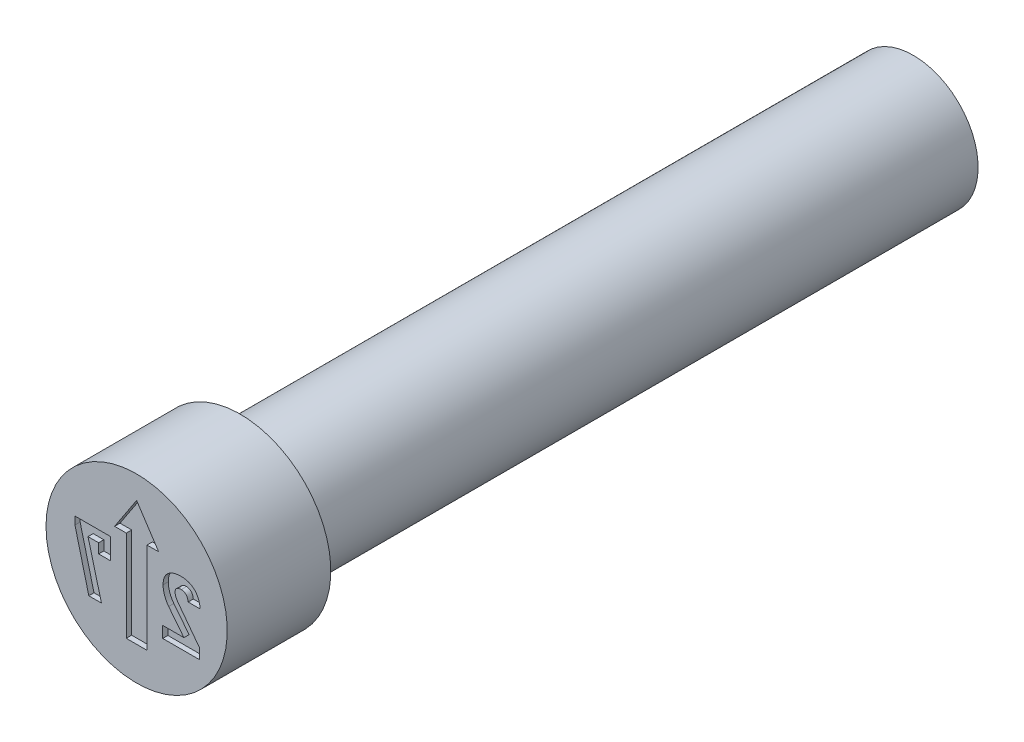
ISO-10303-21;
HEADER;
FILE_DESCRIPTION(('STEP AP214'),'2;1');
FILE_NAME('part.step','',(''),(''),'','','');
FILE_SCHEMA(('AUTOMOTIVE_DESIGN { 1 0 10303 214 1 1 1 1 }'));
ENDSEC;
DATA;
#1=APPLICATION_CONTEXT('core data for automotive mechanical design processes');
#2=APPLICATION_PROTOCOL_DEFINITION('international standard','automotive_design',2000,#1);
#3=PRODUCT_CONTEXT('',#1,'mechanical');
#4=PRODUCT('Part','Part','',(#3));
#5=PRODUCT_RELATED_PRODUCT_CATEGORY('part','',(#4));
#6=PRODUCT_DEFINITION_FORMATION('','',#4);
#7=PRODUCT_DEFINITION_CONTEXT('part definition',#1,'design');
#8=PRODUCT_DEFINITION('design','',#6,#7);
#9=PRODUCT_DEFINITION_SHAPE('','',#8);
#10=(LENGTH_UNIT() NAMED_UNIT(*) SI_UNIT(.MILLI.,.METRE.));
#11=(NAMED_UNIT(*) PLANE_ANGLE_UNIT() SI_UNIT($,.RADIAN.));
#12=(NAMED_UNIT(*) SI_UNIT($,.STERADIAN.) SOLID_ANGLE_UNIT());
#13=UNCERTAINTY_MEASURE_WITH_UNIT(LENGTH_MEASURE(1.E-05),#10,'distance_accuracy_value','');
#14=(GEOMETRIC_REPRESENTATION_CONTEXT(3) GLOBAL_UNCERTAINTY_ASSIGNED_CONTEXT((#13)) GLOBAL_UNIT_ASSIGNED_CONTEXT((#10,
#11,#12)) REPRESENTATION_CONTEXT('',''));
#15=CARTESIAN_POINT('',(0.,0.,0.));
#16=DIRECTION('',(0.,0.,1.));
#17=DIRECTION('',(1.,0.,0.));
#18=AXIS2_PLACEMENT_3D('',#15,#16,#17);
#19=CARTESIAN_POINT('',(-0.2,-1.1,-2.08977062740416));
#20=DIRECTION('',(-1.,0.,0.));
#21=DIRECTION('',(0.,0.,1.));
#22=AXIS2_PLACEMENT_3D('',#19,#20,#21);
#23=PLANE('',#22);
#24=DIRECTION('',(0.,-1.,0.));
#25=VECTOR('',#24,1.);
#26=CARTESIAN_POINT('',(-0.2,0.660419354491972,-0.10447943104));
#27=LINE('',#26,#25);
#28=CARTESIAN_POINT('',(-0.2,0.660419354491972,-0.10447943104));
#29=VERTEX_POINT('',#28);
#30=CARTESIAN_POINT('',(-0.2,-1.1,-0.10447943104));
#31=VERTEX_POINT('',#30);
#32=EDGE_CURVE('E439',#29,#31,#27,.T.);
#33=ORIENTED_EDGE('',*,*,#32,.F.);
#34=DIRECTION('',(0.,0.,1.));
#35=VECTOR('',#34,1.);
#36=CARTESIAN_POINT('',(-0.2,0.660419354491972,-0.14223971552));
#37=LINE('',#36,#35);
#38=CARTESIAN_POINT('',(-0.2,0.660419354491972,0.));
#39=VERTEX_POINT('',#38);
#40=EDGE_CURVE('E425',#39,#29,#37,.F.);
#41=ORIENTED_EDGE('',*,*,#40,.F.);
#42=DIRECTION('',(0.,1.,0.));
#43=VECTOR('',#42,1.);
#44=CARTESIAN_POINT('',(-0.2,0.,0.));
#45=LINE('',#44,#43);
#46=CARTESIAN_POINT('',(-0.2,-1.1,0.));
#47=VERTEX_POINT('',#46);
#48=EDGE_CURVE('E468',#47,#39,#45,.T.);
#49=ORIENTED_EDGE('',*,*,#48,.F.);
#50=DIRECTION('',(0.,0.,-1.));
#51=VECTOR('',#50,1.);
#52=CARTESIAN_POINT('',(-0.2,-1.1,-2.08977062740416));
#53=LINE('',#52,#51);
#54=EDGE_CURVE('E470',#47,#31,#53,.T.);
#55=ORIENTED_EDGE('',*,*,#54,.T.);
#56=EDGE_LOOP('',(#33,#41,#49,#55));
#57=FACE_BOUND('',#56,.T.);
#58=ADVANCED_FACE('F37',(#57),#23,.F.);
#59=CARTESIAN_POINT('',(2.771111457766E-13,0.660419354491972,-0.14223971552));
#60=DIRECTION('',(0.,1.,0.));
#61=DIRECTION('',(0.,0.,1.));
#62=AXIS2_PLACEMENT_3D('',#59,#60,#61);
#63=PLANE('',#62);
#64=ORIENTED_EDGE('',*,*,#40,.T.);
#65=DIRECTION('',(1.,0.,0.));
#66=VECTOR('',#65,1.);
#67=CARTESIAN_POINT('',(-0.425641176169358,0.660419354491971,-0.10447943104));
#68=LINE('',#67,#66);
#69=CARTESIAN_POINT('',(-0.425641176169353,0.660419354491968,-0.10447943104));
#70=VERTEX_POINT('',#69);
#71=EDGE_CURVE('E427',#70,#29,#68,.T.);
#72=ORIENTED_EDGE('',*,*,#71,.F.);
#73=DIRECTION('',(0.,0.,1.));
#74=VECTOR('',#73,1.);
#75=CARTESIAN_POINT('',(-0.425641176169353,0.660419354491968,-0.65023869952));
#76=LINE('',#75,#74);
#77=CARTESIAN_POINT('',(-0.425641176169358,0.660419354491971,0.));
#78=VERTEX_POINT('',#77);
#79=EDGE_CURVE('E432',#70,#78,#76,.T.);
#80=ORIENTED_EDGE('',*,*,#79,.T.);
#81=DIRECTION('',(1.,0.,0.));
#82=VECTOR('',#81,1.);
#83=CARTESIAN_POINT('',(0.87499825,0.660419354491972,0.));
#84=LINE('',#83,#82);
#85=EDGE_CURVE('E430',#39,#78,#84,.F.);
#86=ORIENTED_EDGE('',*,*,#85,.F.);
#87=EDGE_LOOP('',(#64,#72,#80,#86));
#88=FACE_BOUND('',#87,.T.);
#89=ADVANCED_FACE('F415',(#88),#63,.T.);
#90=CARTESIAN_POINT('',(-0.721917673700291,0.210715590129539,-0.65023869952));
#91=DIRECTION('',(-0.835059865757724,0.550159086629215,0.));
#92=DIRECTION('',(-0.550159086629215,-0.835059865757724,0.));
#93=AXIS2_PLACEMENT_3D('',#90,#91,#92);
#94=PLANE('',#93);
#95=DIRECTION('',(-0.55015908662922,-0.835059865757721,0.));
#96=VECTOR('',#95,1.);
#97=CARTESIAN_POINT('',(0.,1.30647950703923,-0.10447943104));
#98=LINE('',#97,#96);
#99=CARTESIAN_POINT('',(0.,1.30647950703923,-0.10447943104));
#100=VERTEX_POINT('',#99);
#101=EDGE_CURVE('E441',#100,#70,#98,.T.);
#102=ORIENTED_EDGE('',*,*,#101,.F.);
#103=DIRECTION('',(0.,0.,1.));
#104=VECTOR('',#103,1.);
#105=CARTESIAN_POINT('',(0.,1.30647950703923,-0.65023869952));
#106=LINE('',#105,#104);
#107=CARTESIAN_POINT('',(0.,1.30647950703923,0.));
#108=VERTEX_POINT('',#107);
#109=EDGE_CURVE('E480',#100,#108,#106,.T.);
#110=ORIENTED_EDGE('',*,*,#109,.T.);
#111=DIRECTION('',(0.550159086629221,0.83505986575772,0.));
#112=VECTOR('',#111,1.);
#113=CARTESIAN_POINT('',(-0.425641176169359,0.660419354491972,0.));
#114=LINE('',#113,#112);
#115=EDGE_CURVE('E464',#78,#108,#114,.T.);
#116=ORIENTED_EDGE('',*,*,#115,.F.);
#117=ORIENTED_EDGE('',*,*,#79,.F.);
#118=EDGE_LOOP('',(#102,#110,#116,#117));
#119=FACE_BOUND('',#118,.T.);
#120=ADVANCED_FACE('F412',(#119),#94,.F.);
#121=CARTESIAN_POINT('',(0.,1.30647950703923,-0.65023869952));
#122=DIRECTION('',(0.835059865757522,0.550159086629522,0.));
#123=DIRECTION('',(-0.550159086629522,0.835059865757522,0.));
#124=AXIS2_PLACEMENT_3D('',#121,#122,#123);
#125=PLANE('',#124);
#126=DIRECTION('',(-0.550159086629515,0.835059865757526,0.));
#127=VECTOR('',#126,1.);
#128=CARTESIAN_POINT('',(0.425641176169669,0.660419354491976,-0.10447943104));
#129=LINE('',#128,#127);
#130=CARTESIAN_POINT('',(0.425641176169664,0.660419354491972,-0.10447943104));
#131=VERTEX_POINT('',#130);
#132=EDGE_CURVE('E445',#131,#100,#129,.T.);
#133=ORIENTED_EDGE('',*,*,#132,.F.);
#134=DIRECTION('',(0.,0.,1.));
#135=VECTOR('',#134,1.);
#136=CARTESIAN_POINT('',(0.425641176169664,0.660419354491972,-0.14223971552));
#137=LINE('',#136,#135);
#138=CARTESIAN_POINT('',(0.425641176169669,0.660419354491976,0.));
#139=VERTEX_POINT('',#138);
#140=EDGE_CURVE('E477',#139,#131,#137,.F.);
#141=ORIENTED_EDGE('',*,*,#140,.F.);
#142=DIRECTION('',(0.550159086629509,-0.83505986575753,0.));
#143=VECTOR('',#142,1.);
#144=CARTESIAN_POINT('',(0.,1.30647950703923,0.));
#145=LINE('',#144,#143);
#146=EDGE_CURVE('E461',#108,#139,#145,.T.);
#147=ORIENTED_EDGE('',*,*,#146,.F.);
#148=ORIENTED_EDGE('',*,*,#109,.F.);
#149=EDGE_LOOP('',(#133,#141,#147,#148));
#150=FACE_BOUND('',#149,.T.);
#151=ADVANCED_FACE('F408',(#150),#125,.F.);
#152=CARTESIAN_POINT('',(2.771111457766E-13,0.660419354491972,-0.14223971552));
#153=DIRECTION('',(0.,1.,0.));
#154=DIRECTION('',(0.,0.,1.));
#155=AXIS2_PLACEMENT_3D('',#152,#153,#154);
#156=PLANE('',#155);
#157=ORIENTED_EDGE('',*,*,#140,.T.);
#158=DIRECTION('',(1.,0.,0.));
#159=VECTOR('',#158,1.);
#160=CARTESIAN_POINT('',(0.2,0.660419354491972,-0.10447943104));
#161=LINE('',#160,#159);
#162=CARTESIAN_POINT('',(0.2,0.660419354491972,-0.10447943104));
#163=VERTEX_POINT('',#162);
#164=EDGE_CURVE('E502',#163,#131,#161,.T.);
#165=ORIENTED_EDGE('',*,*,#164,.F.);
#166=DIRECTION('',(0.,0.,1.));
#167=VECTOR('',#166,1.);
#168=CARTESIAN_POINT('',(0.2,0.660419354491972,-2.08977062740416));
#169=LINE('',#168,#167);
#170=CARTESIAN_POINT('',(0.2,0.660419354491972,0.));
#171=VERTEX_POINT('',#170);
#172=EDGE_CURVE('E475',#163,#171,#169,.T.);
#173=ORIENTED_EDGE('',*,*,#172,.T.);
#174=DIRECTION('',(1.,0.,0.));
#175=VECTOR('',#174,1.);
#176=CARTESIAN_POINT('',(0.87499825,0.660419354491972,0.));
#177=LINE('',#176,#175);
#178=EDGE_CURVE('E458',#139,#171,#177,.F.);
#179=ORIENTED_EDGE('',*,*,#178,.F.);
#180=EDGE_LOOP('',(#157,#165,#173,#179));
#181=FACE_BOUND('',#180,.T.);
#182=ADVANCED_FACE('F404',(#181),#156,.T.);
#183=CARTESIAN_POINT('',(0.2,-1.1,-2.08977062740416));
#184=DIRECTION('',(1.,0.,0.));
#185=DIRECTION('',(0.,1.,0.));
#186=AXIS2_PLACEMENT_3D('',#183,#184,#185);
#187=PLANE('',#186);
#188=DIRECTION('',(0.,1.,0.));
#189=VECTOR('',#188,1.);
#190=CARTESIAN_POINT('',(0.2,-1.1,-0.10447943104));
#191=LINE('',#190,#189);
#192=CARTESIAN_POINT('',(0.2,-1.1,-0.10447943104));
#193=VERTEX_POINT('',#192);
#194=EDGE_CURVE('E433',#193,#163,#191,.T.);
#195=ORIENTED_EDGE('',*,*,#194,.F.);
#196=DIRECTION('',(0.,0.,-1.));
#197=VECTOR('',#196,1.);
#198=CARTESIAN_POINT('',(0.2,-1.1,-2.08977062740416));
#199=LINE('',#198,#197);
#200=CARTESIAN_POINT('',(0.2,-1.1,0.));
#201=VERTEX_POINT('',#200);
#202=EDGE_CURVE('E473',#193,#201,#199,.F.);
#203=ORIENTED_EDGE('',*,*,#202,.T.);
#204=DIRECTION('',(0.,1.,0.));
#205=VECTOR('',#204,1.);
#206=CARTESIAN_POINT('',(0.2,0.,0.));
#207=LINE('',#206,#205);
#208=EDGE_CURVE('E455',#171,#201,#207,.F.);
#209=ORIENTED_EDGE('',*,*,#208,.F.);
#210=ORIENTED_EDGE('',*,*,#172,.F.);
#211=EDGE_LOOP('',(#195,#203,#209,#210));
#212=FACE_BOUND('',#211,.T.);
#213=ADVANCED_FACE('F400',(#212),#187,.F.);
#214=CARTESIAN_POINT('',(-0.2,-1.1,-2.08977062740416));
#215=DIRECTION('',(0.,-1.,0.));
#216=DIRECTION('',(0.,0.,-1.));
#217=AXIS2_PLACEMENT_3D('',#214,#215,#216);
#218=PLANE('',#217);
#219=DIRECTION('',(1.,0.,0.));
#220=VECTOR('',#219,1.);
#221=CARTESIAN_POINT('',(-0.2,-1.1,-0.10447943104));
#222=LINE('',#221,#220);
#223=EDGE_CURVE('E443',#31,#193,#222,.T.);
#224=ORIENTED_EDGE('',*,*,#223,.F.);
#225=ORIENTED_EDGE('',*,*,#54,.F.);
#226=DIRECTION('',(1.,0.,0.));
#227=VECTOR('',#226,1.);
#228=CARTESIAN_POINT('',(0.87499825,-1.1,0.));
#229=LINE('',#228,#227);
#230=EDGE_CURVE('E452',#201,#47,#229,.F.);
#231=ORIENTED_EDGE('',*,*,#230,.F.);
#232=ORIENTED_EDGE('',*,*,#202,.F.);
#233=EDGE_LOOP('',(#224,#225,#231,#232));
#234=FACE_BOUND('',#233,.T.);
#235=ADVANCED_FACE('F383',(#234),#218,.F.);
#236=CARTESIAN_POINT('',(0.87499825,0.,0.));
#237=DIRECTION('',(0.,0.,1.));
#238=DIRECTION('',(1.,0.,0.));
#239=AXIS2_PLACEMENT_3D('',#236,#237,#238);
#240=PLANE('',#239);
#241=DIRECTION('',(-1.,0.,0.));
#242=VECTOR('',#241,1.);
#243=CARTESIAN_POINT('',(-0.50825974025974,0.45,0.));
#244=LINE('',#243,#242);
#245=CARTESIAN_POINT('',(-0.50825974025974,0.45,0.));
#246=VERTEX_POINT('',#245);
#247=CARTESIAN_POINT('',(-1.19105194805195,0.45,0.));
#248=VERTEX_POINT('',#247);
#249=EDGE_CURVE('E53',#246,#248,#244,.T.);
#250=ORIENTED_EDGE('',*,*,#249,.F.);
#251=DIRECTION('',(0.,1.,0.));
#252=VECTOR('',#251,1.);
#253=CARTESIAN_POINT('',(-0.50825974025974,0.0448051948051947,0.));
#254=LINE('',#253,#252);
#255=CARTESIAN_POINT('',(-0.50825974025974,0.0448051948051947,0.));
#256=VERTEX_POINT('',#255);
#257=EDGE_CURVE('E274',#256,#246,#254,.T.);
#258=ORIENTED_EDGE('',*,*,#257,.F.);
#259=DIRECTION('',(1.,0.,0.));
#260=VECTOR('',#259,1.);
#261=CARTESIAN_POINT('',(-0.733503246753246,0.0448051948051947,0.));
#262=LINE('',#261,#260);
#263=CARTESIAN_POINT('',(-0.733503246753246,0.0448051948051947,0.));
#264=VERTEX_POINT('',#263);
#265=EDGE_CURVE('E277',#264,#256,#262,.T.);
#266=ORIENTED_EDGE('',*,*,#265,.F.);
#267=DIRECTION('',(0.,-1.,0.));
#268=VECTOR('',#267,1.);
#269=CARTESIAN_POINT('',(-0.733503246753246,0.231818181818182,0.));
#270=LINE('',#269,#268);
#271=CARTESIAN_POINT('',(-0.733503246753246,0.231818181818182,0.));
#272=VERTEX_POINT('',#271);
#273=EDGE_CURVE('E311',#272,#264,#270,.T.);
#274=ORIENTED_EDGE('',*,*,#273,.F.);
#275=DIRECTION('',(1.,0.,0.));
#276=VECTOR('',#275,1.);
#277=CARTESIAN_POINT('',(-0.93877922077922,0.231818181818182,0.));
#278=LINE('',#277,#276);
#279=CARTESIAN_POINT('',(-0.93877922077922,0.231818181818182,0.));
#280=VERTEX_POINT('',#279);
#281=EDGE_CURVE('E308',#280,#272,#278,.T.);
#282=ORIENTED_EDGE('',*,*,#281,.F.);
#283=DIRECTION('',(-0.255602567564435,0.966781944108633,0.));
#284=VECTOR('',#283,1.);
#285=CARTESIAN_POINT('',(-0.679201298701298,-0.75,0.));
#286=LINE('',#285,#284);
#287=CARTESIAN_POINT('',(-0.679201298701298,-0.75,0.));
#288=VERTEX_POINT('',#287);
#289=EDGE_CURVE('E305',#288,#280,#286,.T.);
#290=ORIENTED_EDGE('',*,*,#289,.F.);
#291=DIRECTION('',(1.,0.,0.));
#292=VECTOR('',#291,1.);
#293=CARTESIAN_POINT('',(-0.923194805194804,-0.75,0.));
#294=LINE('',#293,#292);
#295=CARTESIAN_POINT('',(-0.923194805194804,-0.75,0.));
#296=VERTEX_POINT('',#295);
#297=EDGE_CURVE('E302',#296,#288,#294,.T.);
#298=ORIENTED_EDGE('',*,*,#297,.F.);
#299=DIRECTION('',(0.247293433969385,-0.968940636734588,0.));
#300=VECTOR('',#299,1.);
#301=CARTESIAN_POINT('',(-1.19105194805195,0.299512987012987,0.));
#302=LINE('',#301,#300);
#303=CARTESIAN_POINT('',(-1.19105194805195,0.299512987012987,0.));
#304=VERTEX_POINT('',#303);
#305=EDGE_CURVE('E299',#304,#296,#302,.T.);
#306=ORIENTED_EDGE('',*,*,#305,.F.);
#307=DIRECTION('',(0.,-1.,0.));
#308=VECTOR('',#307,1.);
#309=CARTESIAN_POINT('',(-1.19105194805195,0.45,0.));
#310=LINE('',#309,#308);
#311=EDGE_CURVE('E297',#248,#304,#310,.T.);
#312=ORIENTED_EDGE('',*,*,#311,.F.);
#313=EDGE_LOOP('',(#250,#258,#266,#274,#282,#290,#298,#306,#312));
#314=FACE_BOUND('',#313,.T.);
#315=DIRECTION('',(1.,0.,0.));
#316=VECTOR('',#315,1.);
#317=CARTESIAN_POINT('',(0.504464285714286,-0.75,0.));
#318=LINE('',#317,#316);
#319=CARTESIAN_POINT('',(0.504464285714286,-0.75,0.));
#320=VERTEX_POINT('',#319);
#321=CARTESIAN_POINT('',(1.21112012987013,-0.75,0.));
#322=VERTEX_POINT('',#321);
#323=EDGE_CURVE('E61',#320,#322,#318,.T.);
#324=ORIENTED_EDGE('',*,*,#323,.F.);
#325=DIRECTION('',(0.,-1.,0.));
#326=VECTOR('',#325,1.);
#327=CARTESIAN_POINT('',(0.504464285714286,-0.531818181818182,0.));
#328=LINE('',#327,#326);
#329=CARTESIAN_POINT('',(0.504464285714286,-0.531818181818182,0.));
#330=VERTEX_POINT('',#329);
#331=EDGE_CURVE('E335',#330,#320,#328,.T.);
#332=ORIENTED_EDGE('',*,*,#331,.F.);
#333=DIRECTION('',(-1.,0.,0.));
#334=VECTOR('',#333,1.);
#335=CARTESIAN_POINT('',(0.912824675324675,-0.531818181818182,0.));
#336=LINE('',#335,#334);
#337=CARTESIAN_POINT('',(0.912824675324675,-0.531818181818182,0.));
#338=VERTEX_POINT('',#337);
#339=EDGE_CURVE('E542',#338,#330,#336,.T.);
#340=ORIENTED_EDGE('',*,*,#339,.F.);
#341=DIRECTION('',(0.618183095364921,-0.786034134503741,0.));
#342=VECTOR('',#341,1.);
#343=CARTESIAN_POINT('',(0.618668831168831,-0.157792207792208,0.));
#344=LINE('',#343,#342);
#345=CARTESIAN_POINT('',(0.618668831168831,-0.157792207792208,0.));
#346=VERTEX_POINT('',#345);
#347=EDGE_CURVE('E545',#346,#338,#344,.T.);
#348=ORIENTED_EDGE('',*,*,#347,.F.);
#349=CARTESIAN_POINT('',(0.511038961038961,0.150974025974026,0.));
#350=CARTESIAN_POINT('',(0.511349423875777,0.137320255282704,0.));
#351=CARTESIAN_POINT('',(0.511970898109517,0.10998858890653,0.));
#352=CARTESIAN_POINT('',(0.5175807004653,0.0690829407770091,0.));
#353=CARTESIAN_POINT('',(0.52662078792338,0.0283861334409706,0.));
#354=CARTESIAN_POINT('',(0.539036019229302,-0.0119052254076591,0.));
#355=CARTESIAN_POINT('',(0.554458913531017,-0.0510932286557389,0.));
#356=CARTESIAN_POINT('',(0.572969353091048,-0.0886411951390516,0.));
#357=CARTESIAN_POINT('',(0.593860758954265,-0.124565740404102,0.));
#358=CARTESIAN_POINT('',(0.610415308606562,-0.146737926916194,0.));
#359=CARTESIAN_POINT('',(0.618668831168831,-0.157792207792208,0.));
#360=B_SPLINE_CURVE_WITH_KNOTS('',3,(#349,#350,#351,#352,#353,#354,#355,#356,#357,#358,#359),
.UNSPECIFIED.,.F.,.F.,(4,1,1,1,1,1,1,1,4),(0.,0.123046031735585,0.246309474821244,
0.371480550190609,0.498560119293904,0.626024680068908,0.750715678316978,0.875715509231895,1.),.UNSPECIFIED.);
#361=CARTESIAN_POINT('',(0.511038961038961,0.150974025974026,0.));
#362=VERTEX_POINT('',#361);
#363=EDGE_CURVE('E548',#362,#346,#360,.T.);
#364=ORIENTED_EDGE('',*,*,#363,.F.);
#365=DIRECTION('',(0.,-1.,0.));
#366=VECTOR('',#365,1.);
#367=CARTESIAN_POINT('',(0.511038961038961,0.151948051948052,0.));
#368=LINE('',#367,#366);
#369=CARTESIAN_POINT('',(0.511038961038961,0.151948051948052,0.));
#370=VERTEX_POINT('',#369);
#371=EDGE_CURVE('E553',#370,#362,#368,.T.);
#372=ORIENTED_EDGE('',*,*,#371,.F.);
#373=CARTESIAN_POINT('',(0.864366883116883,0.465584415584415,0.));
#374=CARTESIAN_POINT('',(0.850719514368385,0.465390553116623,0.));
#375=CARTESIAN_POINT('',(0.824177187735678,0.465013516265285,0.));
#376=CARTESIAN_POINT('',(0.785536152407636,0.460943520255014,0.));
#377=CARTESIAN_POINT('',(0.749179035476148,0.454800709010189,0.));
#378=CARTESIAN_POINT('',(0.715164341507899,0.445814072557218,0.));
#379=CARTESIAN_POINT('',(0.683628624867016,0.434091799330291,0.));
#380=CARTESIAN_POINT('',(0.654477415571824,0.419957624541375,0.));
#381=CARTESIAN_POINT('',(0.62764977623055,0.403291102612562,0.));
#382=CARTESIAN_POINT('',(0.603351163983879,0.38405660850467,0.));
#383=CARTESIAN_POINT('',(0.581488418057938,0.362603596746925,0.));
#384=CARTESIAN_POINT('',(0.562670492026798,0.338714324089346,0.));
#385=CARTESIAN_POINT('',(0.54638045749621,0.312871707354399,0.));
#386=CARTESIAN_POINT('',(0.533646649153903,0.2845745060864,0.));
#387=CARTESIAN_POINT('',(0.523163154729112,0.254488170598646,0.));
#388=CARTESIAN_POINT('',(0.516375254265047,0.222073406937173,0.));
#389=CARTESIAN_POINT('',(0.51180107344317,0.187711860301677,0.));
#390=CARTESIAN_POINT('',(0.511297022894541,0.164058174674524,0.));
#391=CARTESIAN_POINT('',(0.511038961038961,0.151948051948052,0.));
#392=B_SPLINE_CURVE_WITH_KNOTS('',3,(#373,#374,#375,#376,#377,#378,#379,#380,#381,#382,#383,
#384,#385,#386,#387,#388,#389,#390,#391),.UNSPECIFIED.,.F.,.F.,(4,1,1,1,1,1,1,1,1,1,1,1,1,1,1,1,
4),(0.,0.0762312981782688,0.148259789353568,0.216860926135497,0.28210063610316,
0.344528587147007,0.404571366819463,0.462840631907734,0.520642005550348,0.577409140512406,
0.633580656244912,0.690215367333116,0.747647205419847,0.806597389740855,0.867894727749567,
0.932365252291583,1.),.UNSPECIFIED.);
#393=CARTESIAN_POINT('',(0.864366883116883,0.465584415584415,0.));
#394=VERTEX_POINT('',#393);
#395=EDGE_CURVE('E559',#394,#370,#392,.T.);
#396=ORIENTED_EDGE('',*,*,#395,.F.);
#397=CARTESIAN_POINT('',(1.22597402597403,0.105438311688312,0.));
#398=CARTESIAN_POINT('',(1.22483495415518,0.11934799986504,0.));
#399=CARTESIAN_POINT('',(1.2226115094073,0.146499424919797,0.));
#400=CARTESIAN_POINT('',(1.21532209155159,0.185775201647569,0.));
#401=CARTESIAN_POINT('',(1.20590080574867,0.22277029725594,0.));
#402=CARTESIAN_POINT('',(1.19391566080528,0.257477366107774,0.));
#403=CARTESIAN_POINT('',(1.17851470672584,0.289494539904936,0.));
#404=CARTESIAN_POINT('',(1.16121126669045,0.3194911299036,0.));
#405=CARTESIAN_POINT('',(1.14039956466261,0.346539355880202,0.));
#406=CARTESIAN_POINT('',(1.11761824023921,0.371544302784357,0.));
#407=CARTESIAN_POINT('',(1.09224391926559,0.393568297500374,0.));
#408=CARTESIAN_POINT('',(1.06518792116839,0.412996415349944,0.));
#409=CARTESIAN_POINT('',(1.03604111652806,0.429163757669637,0.));
#410=CARTESIAN_POINT('',(1.00524661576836,0.442575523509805,0.));
#411=CARTESIAN_POINT('',(0.972462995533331,0.452754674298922,0.));
#412=CARTESIAN_POINT('',(0.938118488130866,0.460379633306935,0.));
#413=CARTESIAN_POINT('',(0.90181888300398,0.464776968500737,0.));
#414=CARTESIAN_POINT('',(0.877040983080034,0.465311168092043,0.));
#415=CARTESIAN_POINT('',(0.864366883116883,0.465584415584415,0.));
#416=B_SPLINE_CURVE_WITH_KNOTS('',3,(#397,#398,#399,#400,#401,#402,#403,#404,#405,#406,#407,
#408,#409,#410,#411,#412,#413,#414,#415),.UNSPECIFIED.,.F.,.F.,(4,1,1,1,1,1,1,1,1,1,1,1,1,1,1,1,
4),(0.,0.0733268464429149,0.14313249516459,0.209679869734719,0.273918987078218,0.33576228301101,
0.396210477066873,0.45560885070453,0.514796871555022,0.573764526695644,0.631900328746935,
0.689592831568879,0.748648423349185,0.808163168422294,0.86976604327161,0.933384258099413,1.),.UNSPECIFIED.);
#417=CARTESIAN_POINT('',(1.22597402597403,0.105438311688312,0.));
#418=VERTEX_POINT('',#417);
#419=EDGE_CURVE('E564',#418,#394,#416,.T.);
#420=ORIENTED_EDGE('',*,*,#419,.F.);
#421=DIRECTION('',(0.,1.,0.));
#422=VECTOR('',#421,1.);
#423=CARTESIAN_POINT('',(1.22597402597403,0.104707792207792,0.));
#424=LINE('',#423,#422);
#425=CARTESIAN_POINT('',(1.22597402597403,0.104707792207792,0.));
#426=VERTEX_POINT('',#425);
#427=EDGE_CURVE('E572',#426,#418,#424,.T.);
#428=ORIENTED_EDGE('',*,*,#427,.F.);
#429=DIRECTION('',(1.,0.,0.));
#430=VECTOR('',#429,1.);
#431=CARTESIAN_POINT('',(0.99512987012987,0.104707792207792,0.));
#432=LINE('',#431,#430);
#433=CARTESIAN_POINT('',(0.99512987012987,0.104707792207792,0.));
#434=VERTEX_POINT('',#433);
#435=EDGE_CURVE('E578',#434,#426,#432,.T.);
#436=ORIENTED_EDGE('',*,*,#435,.F.);
#437=DIRECTION('',(0.,-1.,0.));
#438=VECTOR('',#437,1.);
#439=CARTESIAN_POINT('',(0.99512987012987,0.105438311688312,0.));
#440=LINE('',#439,#438);
#441=CARTESIAN_POINT('',(0.99512987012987,0.105438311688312,0.));
#442=VERTEX_POINT('',#441);
#443=EDGE_CURVE('E581',#442,#434,#440,.T.);
#444=ORIENTED_EDGE('',*,*,#443,.F.);
#445=CARTESIAN_POINT('',(0.862662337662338,0.247402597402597,0.));
#446=CARTESIAN_POINT('',(0.871484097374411,0.247058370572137,0.));
#447=CARTESIAN_POINT('',(0.888625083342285,0.246389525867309,0.));
#448=CARTESIAN_POINT('',(0.912891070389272,0.238976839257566,0.));
#449=CARTESIAN_POINT('',(0.934757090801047,0.227349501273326,0.));
#450=CARTESIAN_POINT('',(0.953607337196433,0.210758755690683,0.));
#451=CARTESIAN_POINT('',(0.9692167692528,0.189928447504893,0.));
#452=CARTESIAN_POINT('',(0.981885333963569,0.165399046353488,0.));
#453=CARTESIAN_POINT('',(0.990489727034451,0.136727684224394,0.));
#454=CARTESIAN_POINT('',(0.993533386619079,0.116203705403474,0.));
#455=CARTESIAN_POINT('',(0.99512987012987,0.105438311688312,0.));
#456=B_SPLINE_CURVE_WITH_KNOTS('',3,(#445,#446,#447,#448,#449,#450,#451,#452,#453,#454,#455),
.UNSPECIFIED.,.F.,.F.,(4,1,1,1,1,1,1,1,4),(0.,0.122603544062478,0.238222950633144,
0.350089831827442,0.465559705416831,0.58502806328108,0.711014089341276,0.848418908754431,1.),.UNSPECIFIED.);
#457=CARTESIAN_POINT('',(0.862662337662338,0.247402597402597,0.));
#458=VERTEX_POINT('',#457);
#459=EDGE_CURVE('E584',#458,#442,#456,.T.);
#460=ORIENTED_EDGE('',*,*,#459,.F.);
#461=CARTESIAN_POINT('',(0.742857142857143,0.145616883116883,0.));
#462=CARTESIAN_POINT('',(0.743189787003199,0.153289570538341,0.));
#463=CARTESIAN_POINT('',(0.743827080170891,0.16798921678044,0.));
#464=CARTESIAN_POINT('',(0.749831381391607,0.188701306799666,0.));
#465=CARTESIAN_POINT('',(0.759672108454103,0.206738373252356,0.));
#466=CARTESIAN_POINT('',(0.773766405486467,0.221636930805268,0.));
#467=CARTESIAN_POINT('',(0.791312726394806,0.23342079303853,0.));
#468=CARTESIAN_POINT('',(0.812307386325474,0.241725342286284,0.));
#469=CARTESIAN_POINT('',(0.836475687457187,0.246487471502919,0.));
#470=CARTESIAN_POINT('',(0.853630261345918,0.247086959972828,0.));
#471=CARTESIAN_POINT('',(0.862662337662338,0.247402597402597,0.));
#472=B_SPLINE_CURVE_WITH_KNOTS('',3,(#461,#462,#463,#464,#465,#466,#467,#468,#469,#470,#471),
.UNSPECIFIED.,.F.,.F.,(4,1,1,1,1,1,1,1,4),(0.,0.128749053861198,0.246662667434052,
0.359069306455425,0.47107757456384,0.588039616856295,0.711712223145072,0.848213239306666,1.),.UNSPECIFIED.);
#473=CARTESIAN_POINT('',(0.742857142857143,0.145616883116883,0.));
#474=VERTEX_POINT('',#473);
#475=EDGE_CURVE('E589',#474,#458,#472,.T.);
#476=ORIENTED_EDGE('',*,*,#475,.F.);
#477=DIRECTION('',(0.,1.,0.));
#478=VECTOR('',#477,1.);
#479=CARTESIAN_POINT('',(0.742857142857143,0.143912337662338,0.));
#480=LINE('',#479,#478);
#481=CARTESIAN_POINT('',(0.742857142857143,0.143912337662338,0.));
#482=VERTEX_POINT('',#481);
#483=EDGE_CURVE('E597',#482,#474,#480,.T.);
#484=ORIENTED_EDGE('',*,*,#483,.F.);
#485=CARTESIAN_POINT('',(0.801055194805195,-0.00267857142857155,0.));
#486=CARTESIAN_POINT('',(0.792466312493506,0.00942362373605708,0.));
#487=CARTESIAN_POINT('',(0.775731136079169,0.0330043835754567,0.));
#488=CARTESIAN_POINT('',(0.760584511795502,0.065387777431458,0.));
#489=CARTESIAN_POINT('',(0.751148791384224,0.0907767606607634,0.));
#490=CARTESIAN_POINT('',(0.746651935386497,0.109188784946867,0.));
#491=CARTESIAN_POINT('',(0.743444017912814,0.126755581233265,0.));
#492=CARTESIAN_POINT('',(0.74304917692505,0.138298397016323,0.));
#493=CARTESIAN_POINT('',(0.742857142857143,0.143912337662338,0.));
#494=B_SPLINE_CURVE_WITH_KNOTS('',3,(#485,#486,#487,#488,#489,#490,#491,#492,#493),
.UNSPECIFIED.,.F.,.F.,(4,1,1,1,1,1,4),(0.,0.27737542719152,0.54045759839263,0.666416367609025,
0.784009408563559,0.894951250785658,1.),.UNSPECIFIED.);
#495=CARTESIAN_POINT('',(0.801055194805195,-0.00267857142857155,0.));
#496=VERTEX_POINT('',#495);
#497=EDGE_CURVE('E603',#496,#482,#494,.T.);
#498=ORIENTED_EDGE('',*,*,#497,.F.);
#499=DIRECTION('',(-0.602458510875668,0.798150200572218,0.));
#500=VECTOR('',#499,1.);
#501=CARTESIAN_POINT('',(1.21112012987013,-0.545941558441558,0.));
#502=LINE('',#501,#500);
#503=CARTESIAN_POINT('',(1.21112012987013,-0.545941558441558,0.));
#504=VERTEX_POINT('',#503);
#505=EDGE_CURVE('E608',#504,#496,#502,.T.);
#506=ORIENTED_EDGE('',*,*,#505,.F.);
#507=DIRECTION('',(0.,1.,0.));
#508=VECTOR('',#507,1.);
#509=CARTESIAN_POINT('',(1.21112012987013,-0.75,0.));
#510=LINE('',#509,#508);
#511=EDGE_CURVE('E614',#322,#504,#510,.T.);
#512=ORIENTED_EDGE('',*,*,#511,.F.);
#513=EDGE_LOOP('',(#324,#332,#340,#348,#364,#372,#396,#420,#428,#436,#444,#460,#476,#484,#498,
#506,#512));
#514=FACE_BOUND('',#513,.T.);
#515=CARTESIAN_POINT('',(0.,0.,0.));
#516=DIRECTION('',(0.,0.,-1.));
#517=DIRECTION('',(-1.,0.,0.));
#518=AXIS2_PLACEMENT_3D('',#515,#516,#517);
#519=CIRCLE('',#518,1.7499965);
#520=CARTESIAN_POINT('',(-1.74999649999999,0.,0.));
#521=VERTEX_POINT('',#520);
#522=EDGE_CURVE('E40',#521,#521,#519,.T.);
#523=ORIENTED_EDGE('',*,*,#522,.F.);
#524=EDGE_LOOP('',(#523));
#525=FACE_BOUND('',#524,.T.);
#526=ORIENTED_EDGE('',*,*,#208,.T.);
#527=ORIENTED_EDGE('',*,*,#230,.T.);
#528=ORIENTED_EDGE('',*,*,#48,.T.);
#529=ORIENTED_EDGE('',*,*,#85,.T.);
#530=ORIENTED_EDGE('',*,*,#115,.T.);
#531=ORIENTED_EDGE('',*,*,#146,.T.);
#532=ORIENTED_EDGE('',*,*,#178,.T.);
#533=EDGE_LOOP('',(#526,#527,#528,#529,#530,#531,#532));
#534=FACE_BOUND('',#533,.T.);
#535=ADVANCED_FACE('F378',(#314,#514,#525,#534),#240,.T.);
#536=CARTESIAN_POINT('',(0.,0.,-0.999998));
#537=DIRECTION('',(0.,0.,-1.));
#538=DIRECTION('',(-1.,0.,0.));
#539=AXIS2_PLACEMENT_3D('',#536,#537,#538);
#540=CYLINDRICAL_SURFACE('',#539,1.7499965);
#541=ORIENTED_EDGE('',*,*,#522,.T.);
#542=EDGE_LOOP('',(#541));
#543=FACE_BOUND('',#542,.T.);
#544=CARTESIAN_POINT('',(0.,0.,-1.999996));
#545=DIRECTION('',(0.,0.,-1.));
#546=DIRECTION('',(-1.,0.,0.));
#547=AXIS2_PLACEMENT_3D('',#544,#545,#546);
#548=CIRCLE('',#547,1.7499965);
#549=CARTESIAN_POINT('',(-1.74999649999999,0.,-1.999996));
#550=VERTEX_POINT('',#549);
#551=EDGE_CURVE('E484',#550,#550,#548,.T.);
#552=ORIENTED_EDGE('',*,*,#551,.F.);
#553=EDGE_LOOP('',(#552));
#554=FACE_BOUND('',#553,.T.);
#555=ADVANCED_FACE('F390',(#543,#554),#540,.T.);
#556=CARTESIAN_POINT('',(0.62499875,0.,-14.99997));
#557=DIRECTION('',(0.,0.,-1.));
#558=DIRECTION('',(-1.,0.,0.));
#559=AXIS2_PLACEMENT_3D('',#556,#557,#558);
#560=PLANE('',#559);
#561=CARTESIAN_POINT('',(0.,0.,-14.99997));
#562=DIRECTION('',(0.,0.,-1.));
#563=DIRECTION('',(-1.,0.,0.));
#564=AXIS2_PLACEMENT_3D('',#561,#562,#563);
#565=CIRCLE('',#564,1.2499975);
#566=CARTESIAN_POINT('',(-1.24999749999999,0.,-14.99997));
#567=VERTEX_POINT('',#566);
#568=EDGE_CURVE('E45',#567,#567,#565,.F.);
#569=ORIENTED_EDGE('',*,*,#568,.F.);
#570=EDGE_LOOP('',(#569));
#571=FACE_BOUND('',#570,.T.);
#572=ADVANCED_FACE('F386',(#571),#560,.T.);
#573=CARTESIAN_POINT('',(1.499997,0.,-1.999996));
#574=DIRECTION('',(0.,0.,-1.));
#575=DIRECTION('',(-1.,0.,0.));
#576=AXIS2_PLACEMENT_3D('',#573,#574,#575);
#577=PLANE('',#576);
#578=CARTESIAN_POINT('',(0.,0.,-1.999996));
#579=DIRECTION('',(0.,0.,-1.));
#580=DIRECTION('',(-1.,0.,0.));
#581=AXIS2_PLACEMENT_3D('',#578,#579,#580);
#582=CIRCLE('',#581,1.2499975);
#583=CARTESIAN_POINT('',(-1.24999749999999,0.,-1.999996));
#584=VERTEX_POINT('',#583);
#585=EDGE_CURVE('E11',#584,#584,#582,.T.);
#586=ORIENTED_EDGE('',*,*,#585,.F.);
#587=EDGE_LOOP('',(#586));
#588=FACE_BOUND('',#587,.T.);
#589=ORIENTED_EDGE('',*,*,#551,.T.);
#590=EDGE_LOOP('',(#589));
#591=FACE_BOUND('',#590,.T.);
#592=ADVANCED_FACE('F381',(#588,#591),#577,.T.);
#593=CARTESIAN_POINT('',(0.,0.,-8.499983));
#594=DIRECTION('',(0.,0.,-1.));
#595=DIRECTION('',(-1.,0.,0.));
#596=AXIS2_PLACEMENT_3D('',#593,#594,#595);
#597=CYLINDRICAL_SURFACE('',#596,1.2499975);
#598=ORIENTED_EDGE('',*,*,#568,.T.);
#599=EDGE_LOOP('',(#598));
#600=FACE_BOUND('',#599,.T.);
#601=ORIENTED_EDGE('',*,*,#585,.T.);
#602=EDGE_LOOP('',(#601));
#603=FACE_BOUND('',#602,.T.);
#604=ADVANCED_FACE('F376',(#600,#603),#597,.T.);
#605=CARTESIAN_POINT('',(0.,0.,-0.10447943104));
#606=DIRECTION('',(0.,0.,-1.));
#607=DIRECTION('',(-1.,0.,0.));
#608=AXIS2_PLACEMENT_3D('',#605,#606,#607);
#609=PLANE('',#608);
#610=ORIENTED_EDGE('',*,*,#164,.T.);
#611=ORIENTED_EDGE('',*,*,#132,.T.);
#612=ORIENTED_EDGE('',*,*,#101,.T.);
#613=ORIENTED_EDGE('',*,*,#71,.T.);
#614=ORIENTED_EDGE('',*,*,#32,.T.);
#615=ORIENTED_EDGE('',*,*,#223,.T.);
#616=ORIENTED_EDGE('',*,*,#194,.T.);
#617=EDGE_LOOP('',(#610,#611,#612,#613,#614,#615,#616));
#618=FACE_BOUND('',#617,.T.);
#619=ADVANCED_FACE('F373',(#618),#609,.F.);
#620=CARTESIAN_POINT('',(0.504464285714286,-0.75,-0.1));
#621=DIRECTION('',(0.,-1.,0.));
#622=DIRECTION('',(0.,0.,-1.));
#623=AXIS2_PLACEMENT_3D('',#620,#621,#622);
#624=PLANE('',#623);
#625=ORIENTED_EDGE('',*,*,#323,.T.);
#626=DIRECTION('',(0.,0.,1.));
#627=VECTOR('',#626,1.);
#628=CARTESIAN_POINT('',(1.21112012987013,-0.75,-0.1));
#629=LINE('',#628,#627);
#630=CARTESIAN_POINT('',(1.21112012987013,-0.75,-0.1));
#631=VERTEX_POINT('',#630);
#632=EDGE_CURVE('E508',#631,#322,#629,.T.);
#633=ORIENTED_EDGE('',*,*,#632,.F.);
#634=DIRECTION('',(1.,0.,0.));
#635=VECTOR('',#634,1.);
#636=CARTESIAN_POINT('',(0.504464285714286,-0.75,-0.1));
#637=LINE('',#636,#635);
#638=CARTESIAN_POINT('',(0.504464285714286,-0.75,-0.1));
#639=VERTEX_POINT('',#638);
#640=EDGE_CURVE('E331',#639,#631,#637,.T.);
#641=ORIENTED_EDGE('',*,*,#640,.F.);
#642=DIRECTION('',(0.,0.,1.));
#643=VECTOR('',#642,1.);
#644=CARTESIAN_POINT('',(0.504464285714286,-0.75,-0.1));
#645=LINE('',#644,#643);
#646=EDGE_CURVE('E503',#639,#320,#645,.T.);
#647=ORIENTED_EDGE('',*,*,#646,.T.);
#648=EDGE_LOOP('',(#625,#633,#641,#647));
#649=FACE_BOUND('',#648,.T.);
#650=ADVANCED_FACE('F369',(#649),#624,.F.);
#651=CARTESIAN_POINT('',(0.504464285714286,-0.531818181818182,-0.1));
#652=DIRECTION('',(-1.,0.,0.));
#653=DIRECTION('',(0.,0.,1.));
#654=AXIS2_PLACEMENT_3D('',#651,#652,#653);
#655=PLANE('',#654);
#656=ORIENTED_EDGE('',*,*,#331,.T.);
#657=ORIENTED_EDGE('',*,*,#646,.F.);
#658=DIRECTION('',(0.,-1.,0.));
#659=VECTOR('',#658,1.);
#660=CARTESIAN_POINT('',(0.504464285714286,-0.531818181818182,-0.1));
#661=LINE('',#660,#659);
#662=CARTESIAN_POINT('',(0.504464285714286,-0.531818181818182,-0.1));
#663=VERTEX_POINT('',#662);
#664=EDGE_CURVE('E511',#663,#639,#661,.T.);
#665=ORIENTED_EDGE('',*,*,#664,.F.);
#666=DIRECTION('',(0.,0.,1.));
#667=VECTOR('',#666,1.);
#668=CARTESIAN_POINT('',(0.504464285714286,-0.531818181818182,-0.1));
#669=LINE('',#668,#667);
#670=EDGE_CURVE('E505',#663,#330,#669,.T.);
#671=ORIENTED_EDGE('',*,*,#670,.T.);
#672=EDGE_LOOP('',(#656,#657,#665,#671));
#673=FACE_BOUND('',#672,.T.);
#674=ADVANCED_FACE('F372',(#673),#655,.F.);
#675=CARTESIAN_POINT('',(0.912824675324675,-0.531818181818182,-0.1));
#676=DIRECTION('',(0.,1.,0.));
#677=DIRECTION('',(0.,0.,1.));
#678=AXIS2_PLACEMENT_3D('',#675,#676,#677);
#679=PLANE('',#678);
#680=ORIENTED_EDGE('',*,*,#339,.T.);
#681=ORIENTED_EDGE('',*,*,#670,.F.);
#682=DIRECTION('',(-1.,0.,0.));
#683=VECTOR('',#682,1.);
#684=CARTESIAN_POINT('',(0.912824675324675,-0.531818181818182,-0.1));
#685=LINE('',#684,#683);
#686=CARTESIAN_POINT('',(0.912824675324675,-0.531818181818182,-0.1));
#687=VERTEX_POINT('',#686);
#688=EDGE_CURVE('E620',#687,#663,#685,.T.);
#689=ORIENTED_EDGE('',*,*,#688,.F.);
#690=DIRECTION('',(0.,0.,1.));
#691=VECTOR('',#690,1.);
#692=CARTESIAN_POINT('',(0.912824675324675,-0.531818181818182,-0.1));
#693=LINE('',#692,#691);
#694=EDGE_CURVE('E537',#687,#338,#693,.T.);
#695=ORIENTED_EDGE('',*,*,#694,.T.);
#696=EDGE_LOOP('',(#680,#681,#689,#695));
#697=FACE_BOUND('',#696,.T.);
#698=ADVANCED_FACE('F735',(#697),#679,.F.);
#699=CARTESIAN_POINT('',(0.618668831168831,-0.157792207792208,-0.1));
#700=DIRECTION('',(-0.786034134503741,-0.618183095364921,0.));
#701=DIRECTION('',(0.618183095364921,-0.786034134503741,0.));
#702=AXIS2_PLACEMENT_3D('',#699,#700,#701);
#703=PLANE('',#702);
#704=ORIENTED_EDGE('',*,*,#347,.T.);
#705=ORIENTED_EDGE('',*,*,#694,.F.);
#706=DIRECTION('',(0.618183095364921,-0.786034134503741,0.));
#707=VECTOR('',#706,1.);
#708=CARTESIAN_POINT('',(0.618668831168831,-0.157792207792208,-0.1));
#709=LINE('',#708,#707);
#710=CARTESIAN_POINT('',(0.618668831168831,-0.157792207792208,-0.1));
#711=VERTEX_POINT('',#710);
#712=EDGE_CURVE('E623',#711,#687,#709,.T.);
#713=ORIENTED_EDGE('',*,*,#712,.F.);
#714=DIRECTION('',(0.,0.,1.));
#715=VECTOR('',#714,1.);
#716=CARTESIAN_POINT('',(0.618668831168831,-0.157792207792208,-0.1));
#717=LINE('',#716,#715);
#718=EDGE_CURVE('E535',#711,#346,#717,.T.);
#719=ORIENTED_EDGE('',*,*,#718,.T.);
#720=EDGE_LOOP('',(#704,#705,#713,#719));
#721=FACE_BOUND('',#720,.T.);
#722=ADVANCED_FACE('F643',(#721),#703,.F.);
#723=CARTESIAN_POINT('',(0.511038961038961,0.150974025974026,-0.1));
#724=CARTESIAN_POINT('',(0.511349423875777,0.137320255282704,-0.1));
#725=CARTESIAN_POINT('',(0.511970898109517,0.10998858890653,-0.1));
#726=CARTESIAN_POINT('',(0.5175807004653,0.0690829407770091,-0.1));
#727=CARTESIAN_POINT('',(0.52662078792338,0.0283861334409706,-0.1));
#728=CARTESIAN_POINT('',(0.539036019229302,-0.0119052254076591,-0.1));
#729=CARTESIAN_POINT('',(0.554458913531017,-0.0510932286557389,-0.1));
#730=CARTESIAN_POINT('',(0.572969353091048,-0.0886411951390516,-0.1));
#731=CARTESIAN_POINT('',(0.593860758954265,-0.124565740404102,-0.1));
#732=CARTESIAN_POINT('',(0.610415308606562,-0.146737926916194,-0.1));
#733=CARTESIAN_POINT('',(0.618668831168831,-0.157792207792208,-0.1));
#734=B_SPLINE_CURVE_WITH_KNOTS('',3,(#723,#724,#725,#726,#727,#728,#729,#730,#731,#732,#733),
.UNSPECIFIED.,.F.,.F.,(4,1,1,1,1,1,1,1,4),(0.,0.123046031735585,0.246309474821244,
0.371480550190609,0.498560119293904,0.626024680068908,0.750715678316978,0.875715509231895,1.),.UNSPECIFIED.);
#735=DIRECTION('',(0.,0.,1.));
#736=VECTOR('',#735,1.);
#737=SURFACE_OF_LINEAR_EXTRUSION('',#734,#736);
#738=ORIENTED_EDGE('',*,*,#363,.T.);
#739=ORIENTED_EDGE('',*,*,#718,.F.);
#740=CARTESIAN_POINT('',(0.511038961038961,0.150974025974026,-0.1));
#741=VERTEX_POINT('',#740);
#742=EDGE_CURVE('E626',#741,#711,#734,.T.);
#743=ORIENTED_EDGE('',*,*,#742,.F.);
#744=DIRECTION('',(0.,0.,1.));
#745=VECTOR('',#744,1.);
#746=CARTESIAN_POINT('',(0.511038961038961,0.150974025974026,-0.1));
#747=LINE('',#746,#745);
#748=EDGE_CURVE('E533',#741,#362,#747,.T.);
#749=ORIENTED_EDGE('',*,*,#748,.T.);
#750=EDGE_LOOP('',(#738,#739,#743,#749));
#751=FACE_BOUND('',#750,.T.);
#752=ADVANCED_FACE('F638',(#751),#737,.F.);
#753=CARTESIAN_POINT('',(0.511038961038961,0.151948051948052,-0.1));
#754=DIRECTION('',(-1.,0.,0.));
#755=DIRECTION('',(0.,0.,1.));
#756=AXIS2_PLACEMENT_3D('',#753,#754,#755);
#757=PLANE('',#756);
#758=ORIENTED_EDGE('',*,*,#371,.T.);
#759=ORIENTED_EDGE('',*,*,#748,.F.);
#760=DIRECTION('',(0.,-1.,0.));
#761=VECTOR('',#760,1.);
#762=CARTESIAN_POINT('',(0.511038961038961,0.151948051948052,-0.1));
#763=LINE('',#762,#761);
#764=CARTESIAN_POINT('',(0.511038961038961,0.151948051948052,-0.1));
#765=VERTEX_POINT('',#764);
#766=EDGE_CURVE('E632',#765,#741,#763,.T.);
#767=ORIENTED_EDGE('',*,*,#766,.F.);
#768=DIRECTION('',(0.,0.,1.));
#769=VECTOR('',#768,1.);
#770=CARTESIAN_POINT('',(0.511038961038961,0.151948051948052,-0.1));
#771=LINE('',#770,#769);
#772=EDGE_CURVE('E531',#765,#370,#771,.T.);
#773=ORIENTED_EDGE('',*,*,#772,.T.);
#774=EDGE_LOOP('',(#758,#759,#767,#773));
#775=FACE_BOUND('',#774,.T.);
#776=ADVANCED_FACE('F642',(#775),#757,.F.);
#777=CARTESIAN_POINT('',(0.864366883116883,0.465584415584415,-0.1));
#778=CARTESIAN_POINT('',(0.850719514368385,0.465390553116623,-0.1));
#779=CARTESIAN_POINT('',(0.824177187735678,0.465013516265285,-0.1));
#780=CARTESIAN_POINT('',(0.785536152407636,0.460943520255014,-0.1));
#781=CARTESIAN_POINT('',(0.749179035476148,0.454800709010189,-0.1));
#782=CARTESIAN_POINT('',(0.715164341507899,0.445814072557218,-0.1));
#783=CARTESIAN_POINT('',(0.683628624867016,0.434091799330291,-0.1));
#784=CARTESIAN_POINT('',(0.654477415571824,0.419957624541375,-0.1));
#785=CARTESIAN_POINT('',(0.62764977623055,0.403291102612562,-0.1));
#786=CARTESIAN_POINT('',(0.603351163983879,0.38405660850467,-0.1));
#787=CARTESIAN_POINT('',(0.581488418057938,0.362603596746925,-0.1));
#788=CARTESIAN_POINT('',(0.562670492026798,0.338714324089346,-0.1));
#789=CARTESIAN_POINT('',(0.54638045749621,0.312871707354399,-0.1));
#790=CARTESIAN_POINT('',(0.533646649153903,0.2845745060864,-0.1));
#791=CARTESIAN_POINT('',(0.523163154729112,0.254488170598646,-0.1));
#792=CARTESIAN_POINT('',(0.516375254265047,0.222073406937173,-0.1));
#793=CARTESIAN_POINT('',(0.51180107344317,0.187711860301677,-0.1));
#794=CARTESIAN_POINT('',(0.511297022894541,0.164058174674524,-0.1));
#795=CARTESIAN_POINT('',(0.511038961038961,0.151948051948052,-0.1));
#796=B_SPLINE_CURVE_WITH_KNOTS('',3,(#777,#778,#779,#780,#781,#782,#783,#784,#785,#786,#787,
#788,#789,#790,#791,#792,#793,#794,#795),.UNSPECIFIED.,.F.,.F.,(4,1,1,1,1,1,1,1,1,1,1,1,1,1,1,1,
4),(0.,0.0762312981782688,0.148259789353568,0.216860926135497,0.28210063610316,
0.344528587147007,0.404571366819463,0.462840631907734,0.520642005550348,0.577409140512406,
0.633580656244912,0.690215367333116,0.747647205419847,0.806597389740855,0.867894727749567,
0.932365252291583,1.),.UNSPECIFIED.);
#797=DIRECTION('',(0.,0.,1.));
#798=VECTOR('',#797,1.);
#799=SURFACE_OF_LINEAR_EXTRUSION('',#796,#798);
#800=ORIENTED_EDGE('',*,*,#395,.T.);
#801=ORIENTED_EDGE('',*,*,#772,.F.);
#802=CARTESIAN_POINT('',(0.864366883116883,0.465584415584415,-0.1));
#803=VERTEX_POINT('',#802);
#804=EDGE_CURVE('E656',#803,#765,#796,.T.);
#805=ORIENTED_EDGE('',*,*,#804,.F.);
#806=DIRECTION('',(0.,0.,1.));
#807=VECTOR('',#806,1.);
#808=CARTESIAN_POINT('',(0.864366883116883,0.465584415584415,-0.1));
#809=LINE('',#808,#807);
#810=EDGE_CURVE('E529',#803,#394,#809,.T.);
#811=ORIENTED_EDGE('',*,*,#810,.T.);
#812=EDGE_LOOP('',(#800,#801,#805,#811));
#813=FACE_BOUND('',#812,.T.);
#814=ADVANCED_FACE('F648',(#813),#799,.F.);
#815=CARTESIAN_POINT('',(1.22597402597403,0.105438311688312,-0.1));
#816=CARTESIAN_POINT('',(1.22483495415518,0.11934799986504,-0.1));
#817=CARTESIAN_POINT('',(1.2226115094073,0.146499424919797,-0.1));
#818=CARTESIAN_POINT('',(1.21532209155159,0.185775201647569,-0.1));
#819=CARTESIAN_POINT('',(1.20590080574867,0.22277029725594,-0.1));
#820=CARTESIAN_POINT('',(1.19391566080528,0.257477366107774,-0.1));
#821=CARTESIAN_POINT('',(1.17851470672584,0.289494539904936,-0.1));
#822=CARTESIAN_POINT('',(1.16121126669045,0.3194911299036,-0.1));
#823=CARTESIAN_POINT('',(1.14039956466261,0.346539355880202,-0.1));
#824=CARTESIAN_POINT('',(1.11761824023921,0.371544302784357,-0.1));
#825=CARTESIAN_POINT('',(1.09224391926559,0.393568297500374,-0.1));
#826=CARTESIAN_POINT('',(1.06518792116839,0.412996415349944,-0.1));
#827=CARTESIAN_POINT('',(1.03604111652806,0.429163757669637,-0.1));
#828=CARTESIAN_POINT('',(1.00524661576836,0.442575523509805,-0.1));
#829=CARTESIAN_POINT('',(0.972462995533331,0.452754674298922,-0.1));
#830=CARTESIAN_POINT('',(0.938118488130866,0.460379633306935,-0.1));
#831=CARTESIAN_POINT('',(0.90181888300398,0.464776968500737,-0.1));
#832=CARTESIAN_POINT('',(0.877040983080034,0.465311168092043,-0.1));
#833=CARTESIAN_POINT('',(0.864366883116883,0.465584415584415,-0.1));
#834=B_SPLINE_CURVE_WITH_KNOTS('',3,(#815,#816,#817,#818,#819,#820,#821,#822,#823,#824,#825,
#826,#827,#828,#829,#830,#831,#832,#833),.UNSPECIFIED.,.F.,.F.,(4,1,1,1,1,1,1,1,1,1,1,1,1,1,1,1,
4),(0.,0.0733268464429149,0.14313249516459,0.209679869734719,0.273918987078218,0.33576228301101,
0.396210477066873,0.45560885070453,0.514796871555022,0.573764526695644,0.631900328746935,
0.689592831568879,0.748648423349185,0.808163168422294,0.86976604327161,0.933384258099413,1.),.UNSPECIFIED.);
#835=DIRECTION('',(0.,0.,1.));
#836=VECTOR('',#835,1.);
#837=SURFACE_OF_LINEAR_EXTRUSION('',#834,#836);
#838=ORIENTED_EDGE('',*,*,#419,.T.);
#839=ORIENTED_EDGE('',*,*,#810,.F.);
#840=CARTESIAN_POINT('',(1.22597402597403,0.105438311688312,-0.1));
#841=VERTEX_POINT('',#840);
#842=EDGE_CURVE('E661',#841,#803,#834,.T.);
#843=ORIENTED_EDGE('',*,*,#842,.F.);
#844=DIRECTION('',(0.,0.,1.));
#845=VECTOR('',#844,1.);
#846=CARTESIAN_POINT('',(1.22597402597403,0.105438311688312,-0.1));
#847=LINE('',#846,#845);
#848=EDGE_CURVE('E527',#841,#418,#847,.T.);
#849=ORIENTED_EDGE('',*,*,#848,.T.);
#850=EDGE_LOOP('',(#838,#839,#843,#849));
#851=FACE_BOUND('',#850,.T.);
#852=ADVANCED_FACE('F652',(#851),#837,.F.);
#853=CARTESIAN_POINT('',(1.22597402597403,0.104707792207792,-0.1));
#854=DIRECTION('',(1.,0.,0.));
#855=DIRECTION('',(0.,0.,-1.));
#856=AXIS2_PLACEMENT_3D('',#853,#854,#855);
#857=PLANE('',#856);
#858=ORIENTED_EDGE('',*,*,#427,.T.);
#859=ORIENTED_EDGE('',*,*,#848,.F.);
#860=DIRECTION('',(0.,1.,0.));
#861=VECTOR('',#860,1.);
#862=CARTESIAN_POINT('',(1.22597402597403,0.104707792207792,-0.1));
#863=LINE('',#862,#861);
#864=CARTESIAN_POINT('',(1.22597402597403,0.104707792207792,-0.1));
#865=VERTEX_POINT('',#864);
#866=EDGE_CURVE('E670',#865,#841,#863,.T.);
#867=ORIENTED_EDGE('',*,*,#866,.F.);
#868=DIRECTION('',(0.,0.,1.));
#869=VECTOR('',#868,1.);
#870=CARTESIAN_POINT('',(1.22597402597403,0.104707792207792,-0.1));
#871=LINE('',#870,#869);
#872=EDGE_CURVE('E525',#865,#426,#871,.T.);
#873=ORIENTED_EDGE('',*,*,#872,.T.);
#874=EDGE_LOOP('',(#858,#859,#867,#873));
#875=FACE_BOUND('',#874,.T.);
#876=ADVANCED_FACE('F751',(#875),#857,.F.);
#877=CARTESIAN_POINT('',(0.99512987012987,0.104707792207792,-0.1));
#878=DIRECTION('',(0.,-1.,0.));
#879=DIRECTION('',(0.,0.,-1.));
#880=AXIS2_PLACEMENT_3D('',#877,#878,#879);
#881=PLANE('',#880);
#882=ORIENTED_EDGE('',*,*,#435,.T.);
#883=ORIENTED_EDGE('',*,*,#872,.F.);
#884=DIRECTION('',(1.,0.,0.));
#885=VECTOR('',#884,1.);
#886=CARTESIAN_POINT('',(0.99512987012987,0.104707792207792,-0.1));
#887=LINE('',#886,#885);
#888=CARTESIAN_POINT('',(0.99512987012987,0.104707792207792,-0.1));
#889=VERTEX_POINT('',#888);
#890=EDGE_CURVE('E676',#889,#865,#887,.T.);
#891=ORIENTED_EDGE('',*,*,#890,.F.);
#892=DIRECTION('',(0.,0.,1.));
#893=VECTOR('',#892,1.);
#894=CARTESIAN_POINT('',(0.99512987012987,0.104707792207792,-0.1));
#895=LINE('',#894,#893);
#896=EDGE_CURVE('E523',#889,#434,#895,.T.);
#897=ORIENTED_EDGE('',*,*,#896,.T.);
#898=EDGE_LOOP('',(#882,#883,#891,#897));
#899=FACE_BOUND('',#898,.T.);
#900=ADVANCED_FACE('F754',(#899),#881,.F.);
#901=CARTESIAN_POINT('',(0.99512987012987,0.105438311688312,-0.1));
#902=DIRECTION('',(-1.,0.,0.));
#903=DIRECTION('',(0.,0.,1.));
#904=AXIS2_PLACEMENT_3D('',#901,#902,#903);
#905=PLANE('',#904);
#906=ORIENTED_EDGE('',*,*,#443,.T.);
#907=ORIENTED_EDGE('',*,*,#896,.F.);
#908=DIRECTION('',(0.,-1.,0.));
#909=VECTOR('',#908,1.);
#910=CARTESIAN_POINT('',(0.99512987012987,0.105438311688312,-0.1));
#911=LINE('',#910,#909);
#912=CARTESIAN_POINT('',(0.99512987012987,0.105438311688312,-0.1));
#913=VERTEX_POINT('',#912);
#914=EDGE_CURVE('E679',#913,#889,#911,.T.);
#915=ORIENTED_EDGE('',*,*,#914,.F.);
#916=DIRECTION('',(0.,0.,1.));
#917=VECTOR('',#916,1.);
#918=CARTESIAN_POINT('',(0.99512987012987,0.105438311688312,-0.1));
#919=LINE('',#918,#917);
#920=EDGE_CURVE('E521',#913,#442,#919,.T.);
#921=ORIENTED_EDGE('',*,*,#920,.T.);
#922=EDGE_LOOP('',(#906,#907,#915,#921));
#923=FACE_BOUND('',#922,.T.);
#924=ADVANCED_FACE('F699',(#923),#905,.F.);
#925=CARTESIAN_POINT('',(0.862662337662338,0.247402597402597,-0.1));
#926=CARTESIAN_POINT('',(0.871484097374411,0.247058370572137,-0.1));
#927=CARTESIAN_POINT('',(0.888625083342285,0.246389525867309,-0.1));
#928=CARTESIAN_POINT('',(0.912891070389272,0.238976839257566,-0.1));
#929=CARTESIAN_POINT('',(0.934757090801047,0.227349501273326,-0.1));
#930=CARTESIAN_POINT('',(0.953607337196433,0.210758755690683,-0.1));
#931=CARTESIAN_POINT('',(0.9692167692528,0.189928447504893,-0.1));
#932=CARTESIAN_POINT('',(0.981885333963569,0.165399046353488,-0.1));
#933=CARTESIAN_POINT('',(0.990489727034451,0.136727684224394,-0.1));
#934=CARTESIAN_POINT('',(0.993533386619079,0.116203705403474,-0.1));
#935=CARTESIAN_POINT('',(0.99512987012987,0.105438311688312,-0.1));
#936=B_SPLINE_CURVE_WITH_KNOTS('',3,(#925,#926,#927,#928,#929,#930,#931,#932,#933,#934,#935),
.UNSPECIFIED.,.F.,.F.,(4,1,1,1,1,1,1,1,4),(0.,0.122603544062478,0.238222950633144,
0.350089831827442,0.465559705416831,0.58502806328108,0.711014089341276,0.848418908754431,1.),.UNSPECIFIED.);
#937=DIRECTION('',(0.,0.,1.));
#938=VECTOR('',#937,1.);
#939=SURFACE_OF_LINEAR_EXTRUSION('',#936,#938);
#940=ORIENTED_EDGE('',*,*,#459,.T.);
#941=ORIENTED_EDGE('',*,*,#920,.F.);
#942=CARTESIAN_POINT('',(0.862662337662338,0.247402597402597,-0.1));
#943=VERTEX_POINT('',#942);
#944=EDGE_CURVE('E682',#943,#913,#936,.T.);
#945=ORIENTED_EDGE('',*,*,#944,.F.);
#946=DIRECTION('',(0.,0.,1.));
#947=VECTOR('',#946,1.);
#948=CARTESIAN_POINT('',(0.862662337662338,0.247402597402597,-0.1));
#949=LINE('',#948,#947);
#950=EDGE_CURVE('E519',#943,#458,#949,.T.);
#951=ORIENTED_EDGE('',*,*,#950,.T.);
#952=EDGE_LOOP('',(#940,#941,#945,#951));
#953=FACE_BOUND('',#952,.T.);
#954=ADVANCED_FACE('F695',(#953),#939,.F.);
#955=CARTESIAN_POINT('',(0.742857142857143,0.145616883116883,-0.1));
#956=CARTESIAN_POINT('',(0.743189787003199,0.153289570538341,-0.1));
#957=CARTESIAN_POINT('',(0.743827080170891,0.16798921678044,-0.1));
#958=CARTESIAN_POINT('',(0.749831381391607,0.188701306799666,-0.1));
#959=CARTESIAN_POINT('',(0.759672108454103,0.206738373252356,-0.1));
#960=CARTESIAN_POINT('',(0.773766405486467,0.221636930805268,-0.1));
#961=CARTESIAN_POINT('',(0.791312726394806,0.23342079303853,-0.1));
#962=CARTESIAN_POINT('',(0.812307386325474,0.241725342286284,-0.1));
#963=CARTESIAN_POINT('',(0.836475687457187,0.246487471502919,-0.1));
#964=CARTESIAN_POINT('',(0.853630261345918,0.247086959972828,-0.1));
#965=CARTESIAN_POINT('',(0.862662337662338,0.247402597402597,-0.1));
#966=B_SPLINE_CURVE_WITH_KNOTS('',3,(#955,#956,#957,#958,#959,#960,#961,#962,#963,#964,#965),
.UNSPECIFIED.,.F.,.F.,(4,1,1,1,1,1,1,1,4),(0.,0.128749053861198,0.246662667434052,
0.359069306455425,0.47107757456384,0.588039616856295,0.711712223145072,0.848213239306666,1.),.UNSPECIFIED.);
#967=DIRECTION('',(0.,0.,1.));
#968=VECTOR('',#967,1.);
#969=SURFACE_OF_LINEAR_EXTRUSION('',#966,#968);
#970=ORIENTED_EDGE('',*,*,#475,.T.);
#971=ORIENTED_EDGE('',*,*,#950,.F.);
#972=CARTESIAN_POINT('',(0.742857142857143,0.145616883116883,-0.1));
#973=VERTEX_POINT('',#972);
#974=EDGE_CURVE('E687',#973,#943,#966,.T.);
#975=ORIENTED_EDGE('',*,*,#974,.F.);
#976=DIRECTION('',(0.,0.,1.));
#977=VECTOR('',#976,1.);
#978=CARTESIAN_POINT('',(0.742857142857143,0.145616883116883,-0.1));
#979=LINE('',#978,#977);
#980=EDGE_CURVE('E517',#973,#474,#979,.T.);
#981=ORIENTED_EDGE('',*,*,#980,.T.);
#982=EDGE_LOOP('',(#970,#971,#975,#981));
#983=FACE_BOUND('',#982,.T.);
#984=ADVANCED_FACE('F698',(#983),#969,.F.);
#985=CARTESIAN_POINT('',(0.742857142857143,0.143912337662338,-0.1));
#986=DIRECTION('',(1.,0.,0.));
#987=DIRECTION('',(0.,0.,-1.));
#988=AXIS2_PLACEMENT_3D('',#985,#986,#987);
#989=PLANE('',#988);
#990=ORIENTED_EDGE('',*,*,#483,.T.);
#991=ORIENTED_EDGE('',*,*,#980,.F.);
#992=DIRECTION('',(0.,1.,0.));
#993=VECTOR('',#992,1.);
#994=CARTESIAN_POINT('',(0.742857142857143,0.143912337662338,-0.1));
#995=LINE('',#994,#993);
#996=CARTESIAN_POINT('',(0.742857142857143,0.143912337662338,-0.1));
#997=VERTEX_POINT('',#996);
#998=EDGE_CURVE('E347',#997,#973,#995,.T.);
#999=ORIENTED_EDGE('',*,*,#998,.F.);
#1000=DIRECTION('',(0.,0.,1.));
#1001=VECTOR('',#1000,1.);
#1002=CARTESIAN_POINT('',(0.742857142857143,0.143912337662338,-0.1));
#1003=LINE('',#1002,#1001);
#1004=EDGE_CURVE('E515',#997,#482,#1003,.T.);
#1005=ORIENTED_EDGE('',*,*,#1004,.T.);
#1006=EDGE_LOOP('',(#990,#991,#999,#1005));
#1007=FACE_BOUND('',#1006,.T.);
#1008=ADVANCED_FACE('F358',(#1007),#989,.F.);
#1009=CARTESIAN_POINT('',(0.801055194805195,-0.00267857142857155,-0.1));
#1010=CARTESIAN_POINT('',(0.792466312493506,0.00942362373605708,-0.1));
#1011=CARTESIAN_POINT('',(0.775731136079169,0.0330043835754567,-0.1));
#1012=CARTESIAN_POINT('',(0.760584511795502,0.065387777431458,-0.1));
#1013=CARTESIAN_POINT('',(0.751148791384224,0.0907767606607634,-0.1));
#1014=CARTESIAN_POINT('',(0.746651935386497,0.109188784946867,-0.1));
#1015=CARTESIAN_POINT('',(0.743444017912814,0.126755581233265,-0.1));
#1016=CARTESIAN_POINT('',(0.74304917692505,0.138298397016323,-0.1));
#1017=CARTESIAN_POINT('',(0.742857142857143,0.143912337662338,-0.1));
#1018=B_SPLINE_CURVE_WITH_KNOTS('',3,(#1009,#1010,#1011,#1012,#1013,#1014,#1015,#1016,#1017),
.UNSPECIFIED.,.F.,.F.,(4,1,1,1,1,1,4),(0.,0.27737542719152,0.54045759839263,0.666416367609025,
0.784009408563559,0.894951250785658,1.),.UNSPECIFIED.);
#1019=DIRECTION('',(0.,0.,1.));
#1020=VECTOR('',#1019,1.);
#1021=SURFACE_OF_LINEAR_EXTRUSION('',#1018,#1020);
#1022=ORIENTED_EDGE('',*,*,#497,.T.);
#1023=ORIENTED_EDGE('',*,*,#1004,.F.);
#1024=CARTESIAN_POINT('',(0.801055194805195,-0.00267857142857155,-0.1));
#1025=VERTEX_POINT('',#1024);
#1026=EDGE_CURVE('E341',#1025,#997,#1018,.T.);
#1027=ORIENTED_EDGE('',*,*,#1026,.F.);
#1028=DIRECTION('',(0.,0.,1.));
#1029=VECTOR('',#1028,1.);
#1030=CARTESIAN_POINT('',(0.801055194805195,-0.00267857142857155,-0.1));
#1031=LINE('',#1030,#1029);
#1032=EDGE_CURVE('E513',#1025,#496,#1031,.T.);
#1033=ORIENTED_EDGE('',*,*,#1032,.T.);
#1034=EDGE_LOOP('',(#1022,#1023,#1027,#1033));
#1035=FACE_BOUND('',#1034,.T.);
#1036=ADVANCED_FACE('F353',(#1035),#1021,.F.);
#1037=CARTESIAN_POINT('',(1.21112012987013,-0.545941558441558,-0.1));
#1038=DIRECTION('',(0.798150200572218,0.602458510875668,0.));
#1039=DIRECTION('',(-0.602458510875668,0.798150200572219,0.));
#1040=AXIS2_PLACEMENT_3D('',#1037,#1038,#1039);
#1041=PLANE('',#1040);
#1042=ORIENTED_EDGE('',*,*,#505,.T.);
#1043=ORIENTED_EDGE('',*,*,#1032,.F.);
#1044=DIRECTION('',(-0.602458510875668,0.798150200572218,0.));
#1045=VECTOR('',#1044,1.);
#1046=CARTESIAN_POINT('',(1.21112012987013,-0.545941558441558,-0.1));
#1047=LINE('',#1046,#1045);
#1048=CARTESIAN_POINT('',(1.21112012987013,-0.545941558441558,-0.1));
#1049=VERTEX_POINT('',#1048);
#1050=EDGE_CURVE('E338',#1049,#1025,#1047,.T.);
#1051=ORIENTED_EDGE('',*,*,#1050,.F.);
#1052=DIRECTION('',(0.,0.,1.));
#1053=VECTOR('',#1052,1.);
#1054=CARTESIAN_POINT('',(1.21112012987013,-0.545941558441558,-0.1));
#1055=LINE('',#1054,#1053);
#1056=EDGE_CURVE('E510',#1049,#504,#1055,.T.);
#1057=ORIENTED_EDGE('',*,*,#1056,.T.);
#1058=EDGE_LOOP('',(#1042,#1043,#1051,#1057));
#1059=FACE_BOUND('',#1058,.T.);
#1060=ADVANCED_FACE('F357',(#1059),#1041,.F.);
#1061=CARTESIAN_POINT('',(1.21112012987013,-0.75,-0.1));
#1062=DIRECTION('',(1.,0.,0.));
#1063=DIRECTION('',(0.,0.,-1.));
#1064=AXIS2_PLACEMENT_3D('',#1061,#1062,#1063);
#1065=PLANE('',#1064);
#1066=ORIENTED_EDGE('',*,*,#511,.T.);
#1067=ORIENTED_EDGE('',*,*,#1056,.F.);
#1068=DIRECTION('',(0.,1.,0.));
#1069=VECTOR('',#1068,1.);
#1070=CARTESIAN_POINT('',(1.21112012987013,-0.75,-0.1));
#1071=LINE('',#1070,#1069);
#1072=EDGE_CURVE('E334',#631,#1049,#1071,.T.);
#1073=ORIENTED_EDGE('',*,*,#1072,.F.);
#1074=ORIENTED_EDGE('',*,*,#632,.T.);
#1075=EDGE_LOOP('',(#1066,#1067,#1073,#1074));
#1076=FACE_BOUND('',#1075,.T.);
#1077=ADVANCED_FACE('F363',(#1076),#1065,.F.);
#1078=CARTESIAN_POINT('',(0.760672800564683,0.0663192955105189,-0.1));
#1079=DIRECTION('',(0.,0.,1.));
#1080=DIRECTION('',(1.,0.,0.));
#1081=AXIS2_PLACEMENT_3D('',#1078,#1079,#1080);
#1082=PLANE('',#1081);
#1083=ORIENTED_EDGE('',*,*,#640,.T.);
#1084=ORIENTED_EDGE('',*,*,#1072,.T.);
#1085=ORIENTED_EDGE('',*,*,#1050,.T.);
#1086=ORIENTED_EDGE('',*,*,#1026,.T.);
#1087=ORIENTED_EDGE('',*,*,#998,.T.);
#1088=ORIENTED_EDGE('',*,*,#974,.T.);
#1089=ORIENTED_EDGE('',*,*,#944,.T.);
#1090=ORIENTED_EDGE('',*,*,#914,.T.);
#1091=ORIENTED_EDGE('',*,*,#890,.T.);
#1092=ORIENTED_EDGE('',*,*,#866,.T.);
#1093=ORIENTED_EDGE('',*,*,#842,.T.);
#1094=ORIENTED_EDGE('',*,*,#804,.T.);
#1095=ORIENTED_EDGE('',*,*,#766,.T.);
#1096=ORIENTED_EDGE('',*,*,#742,.T.);
#1097=ORIENTED_EDGE('',*,*,#712,.T.);
#1098=ORIENTED_EDGE('',*,*,#688,.T.);
#1099=ORIENTED_EDGE('',*,*,#664,.T.);
#1100=EDGE_LOOP('',(#1083,#1084,#1085,#1086,#1087,#1088,#1089,#1090,#1091,#1092,#1093,#1094,
#1095,#1096,#1097,#1098,#1099));
#1101=FACE_BOUND('',#1100,.T.);
#1102=ADVANCED_FACE('F367',(#1101),#1082,.T.);
#1103=CARTESIAN_POINT('',(-0.50825974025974,0.45,-0.1));
#1104=DIRECTION('',(0.,1.,0.));
#1105=DIRECTION('',(0.,0.,1.));
#1106=AXIS2_PLACEMENT_3D('',#1103,#1104,#1105);
#1107=PLANE('',#1106);
#1108=ORIENTED_EDGE('',*,*,#249,.T.);
#1109=DIRECTION('',(0.,0.,1.));
#1110=VECTOR('',#1109,1.);
#1111=CARTESIAN_POINT('',(-1.19105194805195,0.45,-0.1));
#1112=LINE('',#1111,#1110);
#1113=CARTESIAN_POINT('',(-1.19105194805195,0.45,-0.1));
#1114=VERTEX_POINT('',#1113);
#1115=EDGE_CURVE('E251',#1114,#248,#1112,.T.);
#1116=ORIENTED_EDGE('',*,*,#1115,.F.);
#1117=DIRECTION('',(-1.,0.,0.));
#1118=VECTOR('',#1117,1.);
#1119=CARTESIAN_POINT('',(-0.50825974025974,0.45,-0.1));
#1120=LINE('',#1119,#1118);
#1121=CARTESIAN_POINT('',(-0.50825974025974,0.45,-0.1));
#1122=VERTEX_POINT('',#1121);
#1123=EDGE_CURVE('E255',#1122,#1114,#1120,.T.);
#1124=ORIENTED_EDGE('',*,*,#1123,.F.);
#1125=DIRECTION('',(0.,0.,1.));
#1126=VECTOR('',#1125,1.);
#1127=CARTESIAN_POINT('',(-0.50825974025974,0.45,-0.1));
#1128=LINE('',#1127,#1126);
#1129=EDGE_CURVE('E316',#1122,#246,#1128,.T.);
#1130=ORIENTED_EDGE('',*,*,#1129,.T.);
#1131=EDGE_LOOP('',(#1108,#1116,#1124,#1130));
#1132=FACE_BOUND('',#1131,.T.);
#1133=ADVANCED_FACE('F253',(#1132),#1107,.F.);
#1134=CARTESIAN_POINT('',(-0.50825974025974,0.0448051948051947,-0.1));
#1135=DIRECTION('',(1.,0.,0.));
#1136=DIRECTION('',(0.,0.,-1.));
#1137=AXIS2_PLACEMENT_3D('',#1134,#1135,#1136);
#1138=PLANE('',#1137);
#1139=ORIENTED_EDGE('',*,*,#257,.T.);
#1140=ORIENTED_EDGE('',*,*,#1129,.F.);
#1141=DIRECTION('',(0.,1.,0.));
#1142=VECTOR('',#1141,1.);
#1143=CARTESIAN_POINT('',(-0.50825974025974,0.0448051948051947,-0.1));
#1144=LINE('',#1143,#1142);
#1145=CARTESIAN_POINT('',(-0.50825974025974,0.0448051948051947,-0.1));
#1146=VERTEX_POINT('',#1145);
#1147=EDGE_CURVE('E261',#1146,#1122,#1144,.T.);
#1148=ORIENTED_EDGE('',*,*,#1147,.F.);
#1149=DIRECTION('',(0.,0.,1.));
#1150=VECTOR('',#1149,1.);
#1151=CARTESIAN_POINT('',(-0.50825974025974,0.0448051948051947,-0.1));
#1152=LINE('',#1151,#1150);
#1153=EDGE_CURVE('E318',#1146,#256,#1152,.T.);
#1154=ORIENTED_EDGE('',*,*,#1153,.T.);
#1155=EDGE_LOOP('',(#1139,#1140,#1148,#1154));
#1156=FACE_BOUND('',#1155,.T.);
#1157=ADVANCED_FACE('F977',(#1156),#1138,.F.);
#1158=CARTESIAN_POINT('',(-0.733503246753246,0.0448051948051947,-0.1));
#1159=DIRECTION('',(0.,-1.,0.));
#1160=DIRECTION('',(0.,0.,-1.));
#1161=AXIS2_PLACEMENT_3D('',#1158,#1159,#1160);
#1162=PLANE('',#1161);
#1163=ORIENTED_EDGE('',*,*,#265,.T.);
#1164=ORIENTED_EDGE('',*,*,#1153,.F.);
#1165=DIRECTION('',(1.,0.,0.));
#1166=VECTOR('',#1165,1.);
#1167=CARTESIAN_POINT('',(-0.733503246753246,0.0448051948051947,-0.1));
#1168=LINE('',#1167,#1166);
#1169=CARTESIAN_POINT('',(-0.733503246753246,0.0448051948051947,-0.1));
#1170=VERTEX_POINT('',#1169);
#1171=EDGE_CURVE('E293',#1170,#1146,#1168,.T.);
#1172=ORIENTED_EDGE('',*,*,#1171,.F.);
#1173=DIRECTION('',(0.,0.,1.));
#1174=VECTOR('',#1173,1.);
#1175=CARTESIAN_POINT('',(-0.733503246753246,0.0448051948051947,-0.1));
#1176=LINE('',#1175,#1174);
#1177=EDGE_CURVE('E320',#1170,#264,#1176,.T.);
#1178=ORIENTED_EDGE('',*,*,#1177,.T.);
#1179=EDGE_LOOP('',(#1163,#1164,#1172,#1178));
#1180=FACE_BOUND('',#1179,.T.);
#1181=ADVANCED_FACE('F987',(#1180),#1162,.F.);
#1182=CARTESIAN_POINT('',(-0.733503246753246,0.231818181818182,-0.1));
#1183=DIRECTION('',(-1.,0.,0.));
#1184=DIRECTION('',(0.,0.,1.));
#1185=AXIS2_PLACEMENT_3D('',#1182,#1183,#1184);
#1186=PLANE('',#1185);
#1187=ORIENTED_EDGE('',*,*,#273,.T.);
#1188=ORIENTED_EDGE('',*,*,#1177,.F.);
#1189=DIRECTION('',(0.,-1.,0.));
#1190=VECTOR('',#1189,1.);
#1191=CARTESIAN_POINT('',(-0.733503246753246,0.231818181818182,-0.1));
#1192=LINE('',#1191,#1190);
#1193=CARTESIAN_POINT('',(-0.733503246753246,0.231818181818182,-0.1));
#1194=VERTEX_POINT('',#1193);
#1195=EDGE_CURVE('E290',#1194,#1170,#1192,.T.);
#1196=ORIENTED_EDGE('',*,*,#1195,.F.);
#1197=DIRECTION('',(0.,0.,1.));
#1198=VECTOR('',#1197,1.);
#1199=CARTESIAN_POINT('',(-0.733503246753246,0.231818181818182,-0.1));
#1200=LINE('',#1199,#1198);
#1201=EDGE_CURVE('E322',#1194,#272,#1200,.T.);
#1202=ORIENTED_EDGE('',*,*,#1201,.T.);
#1203=EDGE_LOOP('',(#1187,#1188,#1196,#1202));
#1204=FACE_BOUND('',#1203,.T.);
#1205=ADVANCED_FACE('F998',(#1204),#1186,.F.);
#1206=CARTESIAN_POINT('',(-0.93877922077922,0.231818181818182,-0.1));
#1207=DIRECTION('',(0.,-1.,0.));
#1208=DIRECTION('',(0.,0.,-1.));
#1209=AXIS2_PLACEMENT_3D('',#1206,#1207,#1208);
#1210=PLANE('',#1209);
#1211=ORIENTED_EDGE('',*,*,#281,.T.);
#1212=ORIENTED_EDGE('',*,*,#1201,.F.);
#1213=DIRECTION('',(1.,0.,0.));
#1214=VECTOR('',#1213,1.);
#1215=CARTESIAN_POINT('',(-0.93877922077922,0.231818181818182,-0.1));
#1216=LINE('',#1215,#1214);
#1217=CARTESIAN_POINT('',(-0.93877922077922,0.231818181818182,-0.1));
#1218=VERTEX_POINT('',#1217);
#1219=EDGE_CURVE('E287',#1218,#1194,#1216,.T.);
#1220=ORIENTED_EDGE('',*,*,#1219,.F.);
#1221=DIRECTION('',(0.,0.,1.));
#1222=VECTOR('',#1221,1.);
#1223=CARTESIAN_POINT('',(-0.93877922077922,0.231818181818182,-0.1));
#1224=LINE('',#1223,#1222);
#1225=EDGE_CURVE('E324',#1218,#280,#1224,.T.);
#1226=ORIENTED_EDGE('',*,*,#1225,.T.);
#1227=EDGE_LOOP('',(#1211,#1212,#1220,#1226));
#1228=FACE_BOUND('',#1227,.T.);
#1229=ADVANCED_FACE('F1009',(#1228),#1210,.F.);
#1230=CARTESIAN_POINT('',(-0.679201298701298,-0.75,-0.1));
#1231=DIRECTION('',(0.966781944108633,0.255602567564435,0.));
#1232=DIRECTION('',(-0.255602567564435,0.966781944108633,0.));
#1233=AXIS2_PLACEMENT_3D('',#1230,#1231,#1232);
#1234=PLANE('',#1233);
#1235=ORIENTED_EDGE('',*,*,#289,.T.);
#1236=ORIENTED_EDGE('',*,*,#1225,.F.);
#1237=DIRECTION('',(-0.255602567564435,0.966781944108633,0.));
#1238=VECTOR('',#1237,1.);
#1239=CARTESIAN_POINT('',(-0.679201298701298,-0.75,-0.1));
#1240=LINE('',#1239,#1238);
#1241=CARTESIAN_POINT('',(-0.679201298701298,-0.75,-0.1));
#1242=VERTEX_POINT('',#1241);
#1243=EDGE_CURVE('E284',#1242,#1218,#1240,.T.);
#1244=ORIENTED_EDGE('',*,*,#1243,.F.);
#1245=DIRECTION('',(0.,0.,1.));
#1246=VECTOR('',#1245,1.);
#1247=CARTESIAN_POINT('',(-0.679201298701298,-0.75,-0.1));
#1248=LINE('',#1247,#1246);
#1249=EDGE_CURVE('E326',#1242,#288,#1248,.T.);
#1250=ORIENTED_EDGE('',*,*,#1249,.T.);
#1251=EDGE_LOOP('',(#1235,#1236,#1244,#1250));
#1252=FACE_BOUND('',#1251,.T.);
#1253=ADVANCED_FACE('F1020',(#1252),#1234,.F.);
#1254=CARTESIAN_POINT('',(-0.923194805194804,-0.75,-0.1));
#1255=DIRECTION('',(0.,-1.,0.));
#1256=DIRECTION('',(0.,0.,-1.));
#1257=AXIS2_PLACEMENT_3D('',#1254,#1255,#1256);
#1258=PLANE('',#1257);
#1259=ORIENTED_EDGE('',*,*,#297,.T.);
#1260=ORIENTED_EDGE('',*,*,#1249,.F.);
#1261=DIRECTION('',(1.,0.,0.));
#1262=VECTOR('',#1261,1.);
#1263=CARTESIAN_POINT('',(-0.923194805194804,-0.75,-0.1));
#1264=LINE('',#1263,#1262);
#1265=CARTESIAN_POINT('',(-0.923194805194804,-0.75,-0.1));
#1266=VERTEX_POINT('',#1265);
#1267=EDGE_CURVE('E281',#1266,#1242,#1264,.T.);
#1268=ORIENTED_EDGE('',*,*,#1267,.F.);
#1269=DIRECTION('',(0.,0.,1.));
#1270=VECTOR('',#1269,1.);
#1271=CARTESIAN_POINT('',(-0.923194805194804,-0.75,-0.1));
#1272=LINE('',#1271,#1270);
#1273=EDGE_CURVE('E328',#1266,#296,#1272,.T.);
#1274=ORIENTED_EDGE('',*,*,#1273,.T.);
#1275=EDGE_LOOP('',(#1259,#1260,#1268,#1274));
#1276=FACE_BOUND('',#1275,.T.);
#1277=ADVANCED_FACE('F1031',(#1276),#1258,.F.);
#1278=CARTESIAN_POINT('',(-1.19105194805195,0.299512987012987,-0.1));
#1279=DIRECTION('',(-0.968940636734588,-0.247293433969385,0.));
#1280=DIRECTION('',(0.247293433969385,-0.968940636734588,0.));
#1281=AXIS2_PLACEMENT_3D('',#1278,#1279,#1280);
#1282=PLANE('',#1281);
#1283=ORIENTED_EDGE('',*,*,#305,.T.);
#1284=ORIENTED_EDGE('',*,*,#1273,.F.);
#1285=DIRECTION('',(0.247293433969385,-0.968940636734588,0.));
#1286=VECTOR('',#1285,1.);
#1287=CARTESIAN_POINT('',(-1.19105194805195,0.299512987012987,-0.1));
#1288=LINE('',#1287,#1286);
#1289=CARTESIAN_POINT('',(-1.19105194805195,0.299512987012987,-0.1));
#1290=VERTEX_POINT('',#1289);
#1291=EDGE_CURVE('E269',#1290,#1266,#1288,.T.);
#1292=ORIENTED_EDGE('',*,*,#1291,.F.);
#1293=DIRECTION('',(0.,0.,1.));
#1294=VECTOR('',#1293,1.);
#1295=CARTESIAN_POINT('',(-1.19105194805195,0.299512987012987,-0.1));
#1296=LINE('',#1295,#1294);
#1297=EDGE_CURVE('E260',#1290,#304,#1296,.T.);
#1298=ORIENTED_EDGE('',*,*,#1297,.T.);
#1299=EDGE_LOOP('',(#1283,#1284,#1292,#1298));
#1300=FACE_BOUND('',#1299,.T.);
#1301=ADVANCED_FACE('F1042',(#1300),#1282,.F.);
#1302=CARTESIAN_POINT('',(-1.19105194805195,0.45,-0.1));
#1303=DIRECTION('',(-1.,0.,0.));
#1304=DIRECTION('',(0.,0.,1.));
#1305=AXIS2_PLACEMENT_3D('',#1302,#1303,#1304);
#1306=PLANE('',#1305);
#1307=ORIENTED_EDGE('',*,*,#311,.T.);
#1308=ORIENTED_EDGE('',*,*,#1297,.F.);
#1309=DIRECTION('',(0.,-1.,0.));
#1310=VECTOR('',#1309,1.);
#1311=CARTESIAN_POINT('',(-1.19105194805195,0.45,-0.1));
#1312=LINE('',#1311,#1310);
#1313=EDGE_CURVE('E264',#1114,#1290,#1312,.T.);
#1314=ORIENTED_EDGE('',*,*,#1313,.F.);
#1315=ORIENTED_EDGE('',*,*,#1115,.T.);
#1316=EDGE_LOOP('',(#1307,#1308,#1314,#1315));
#1317=FACE_BOUND('',#1316,.T.);
#1318=ADVANCED_FACE('F265',(#1317),#1306,.F.);
#1319=CARTESIAN_POINT('',(0.,0.,-0.1));
#1320=DIRECTION('',(0.,0.,1.));
#1321=DIRECTION('',(1.,0.,0.));
#1322=AXIS2_PLACEMENT_3D('',#1319,#1320,#1321);
#1323=PLANE('',#1322);
#1324=ORIENTED_EDGE('',*,*,#1123,.T.);
#1325=ORIENTED_EDGE('',*,*,#1313,.T.);
#1326=ORIENTED_EDGE('',*,*,#1291,.T.);
#1327=ORIENTED_EDGE('',*,*,#1267,.T.);
#1328=ORIENTED_EDGE('',*,*,#1243,.T.);
#1329=ORIENTED_EDGE('',*,*,#1219,.T.);
#1330=ORIENTED_EDGE('',*,*,#1195,.T.);
#1331=ORIENTED_EDGE('',*,*,#1171,.T.);
#1332=ORIENTED_EDGE('',*,*,#1147,.T.);
#1333=EDGE_LOOP('',(#1324,#1325,#1326,#1327,#1328,#1329,#1330,#1331,#1332));
#1334=FACE_BOUND('',#1333,.T.);
#1335=ADVANCED_FACE('F271',(#1334),#1323,.T.);
#1336=CLOSED_SHELL('',(#58,#89,#120,#151,#182,#213,#235,#535,#555,#572,#592,#604,#619,#650,#674,
#698,#722,#752,#776,#814,#852,#876,#900,#924,#954,#984,#1008,#1036,#1060,#1077,#1102,#1133,
#1157,#1181,#1205,#1229,#1253,#1277,#1301,#1318,#1335));
#1337=MANIFOLD_SOLID_BREP('B2',#1336);
#1338=ADVANCED_BREP_SHAPE_REPRESENTATION('',(#18,#1337),#14);
#1339=SHAPE_DEFINITION_REPRESENTATION(#9,#1338);
ENDSEC;
END-ISO-10303-21;
